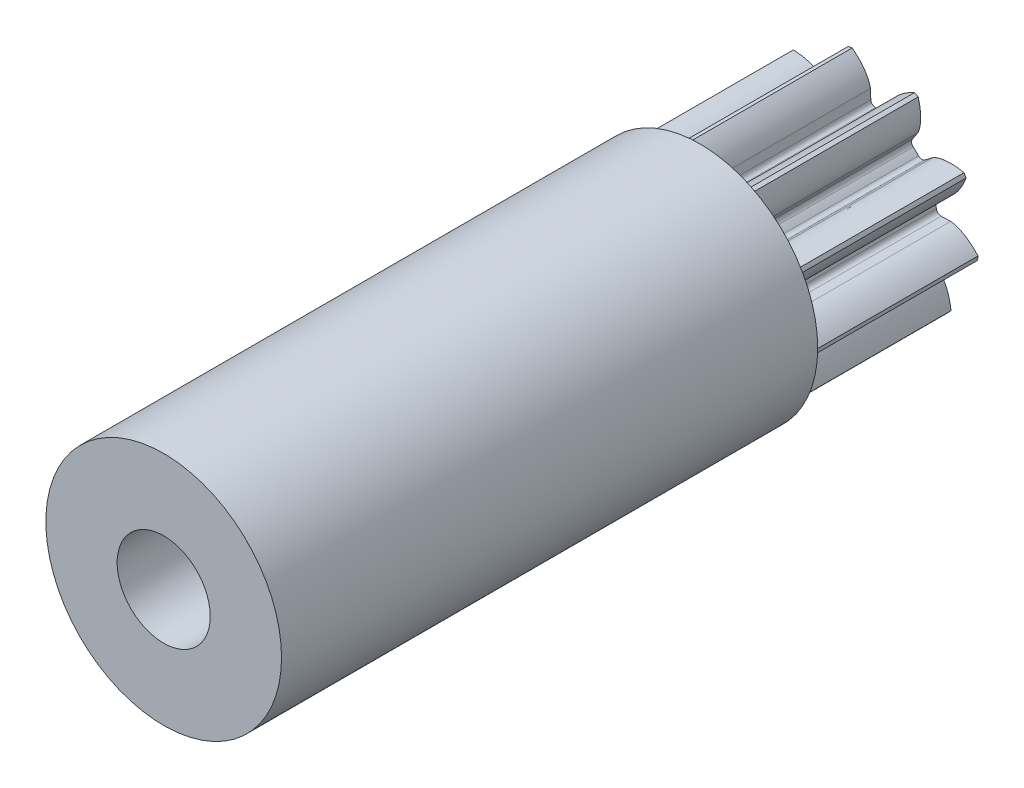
from build123d import *

# Parameters (mm, degrees)
ESQUISSE1_W        = 1
ESQUISSE1_H        = 4.55
BOSS_EXTRU_1_DEPTH = 1.45
PER_AGE1_D         = 0.79
PER_AGE1_DEPTH     = 4.2
CONG_1_R           = 0.04
CONG_2_R           = 0.2


with BuildPart() as part:
    # Esquisse1 → R_volution1 (revolve)
    with BuildSketch(Plane(origin=(0, 0, 0), x_dir=(1, 0, 0), z_dir=(0, 1, 0))):
        with Locations((0.5, -8.625)):
            Rectangle(ESQUISSE1_W, ESQUISSE1_H)
    revolve(axis=Axis((0, 0, 6.35), (0, 0, 1)))

    # Esquisse2 → Boss.-Extru.1 (add)
    with BuildSketch(Plane(origin=(0, 0, 6.35), x_dir=(-1, 0, 0), z_dir=(0, 0, -1))):
        with BuildLine():
            Line((0.002392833, -0.562494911), (-0.003155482, -0.679723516))
            add(Edge.make_bspline(
                [(-0.003155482, -0.679723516), (-0.003805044, -0.693447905), (-0.008104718, -0.706890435), (-0.012835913, -0.719789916), (-0.0255126, -0.754352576), (-0.045809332, -0.786237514), (-0.068738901, -0.815038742), (-0.094375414, -0.84724009), (-0.124574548, -0.876031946), (-0.156958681, -0.90143717)],
                knots=[0, 0, 0, 0, 4.1219e-05, 4.1219e-05, 4.1219e-05, 0.000152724, 0.000152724, 0.000152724, 0.000277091, 0.000277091, 0.000277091, 0.000277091], degree=3))
            ThreePointArc((-0.156958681, -0.90143717), (-0.174339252, -0.898237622), (-0.191654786, -0.894702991))
            add(Edge.make_bspline(
                [(-0.191654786, -0.894702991), (-0.204416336, -0.872526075), (-0.215896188, -0.849528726), (-0.225560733, -0.825837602), (-0.235219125, -0.802161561), (-0.243088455, -0.777646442), (-0.248696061, -0.752698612), (-0.254160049, -0.728389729), (-0.257630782, -0.703384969), (-0.257477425, -0.678470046), (-0.257380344, -0.662697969), (-0.256552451, -0.646441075), (-0.251350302, -0.631551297)],
                knots=[0, 0, 0, 0, 7.676e-05, 7.676e-05, 7.676e-05, 0.000153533, 0.000153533, 0.000153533, 0.000228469, 0.000228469, 0.000228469, 0.000275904, 0.000275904, 0.000275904, 0.000275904], degree=3))
            Line((-0.251350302, -0.631551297), (-0.212641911, -0.520758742))
            ThreePointArc((-0.212641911, -0.520758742), (-0.272567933, -0.492049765), (-0.32869037, -0.456474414))
            Line((-0.32869037, -0.456474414), (-0.402084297, -0.54805313))
            add(Edge.make_bspline(
                [(-0.402084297, -0.54805313), (-0.410676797, -0.558774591), (-0.422056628, -0.567122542), (-0.433466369, -0.574777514), (-0.464037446, -0.595288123), (-0.499199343, -0.609153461), (-0.534678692, -0.618976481), (-0.574346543, -0.629959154), (-0.615701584, -0.63550165), (-0.656833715, -0.637019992)],
                knots=[0, 0, 0, 0, 4.1219e-05, 4.1219e-05, 4.1219e-05, 0.000152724, 0.000152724, 0.000152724, 0.000277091, 0.000277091, 0.000277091, 0.000277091], degree=3))
            ThreePointArc((-0.656833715, -0.637019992), (-0.669014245, -0.62421546), (-0.680945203, -0.611178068))
            add(Edge.make_bspline(
                [(-0.680945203, -0.611178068), (-0.678234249, -0.585735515), (-0.674004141, -0.560382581), (-0.66789763, -0.535535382), (-0.661795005, -0.510704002), (-0.653751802, -0.486245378), (-0.643624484, -0.462766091), (-0.63375654, -0.439888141), (-0.621866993, -0.417618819), (-0.607098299, -0.397552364), (-0.597749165, -0.384849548), (-0.587523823, -0.372184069), (-0.574563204, -0.363195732)],
                knots=[0, 0, 0, 0, 7.676e-05, 7.676e-05, 7.676e-05, 0.000153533, 0.000153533, 0.000153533, 0.000228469, 0.000228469, 0.000228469, 0.000275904, 0.000275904, 0.000275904, 0.000275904], degree=3))
            Line((-0.574563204, -0.363195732), (-0.478125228, -0.296314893))
            ThreePointArc((-0.478125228, -0.296314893), (-0.509731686, -0.237865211), (-0.534225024, -0.176096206))
            Line((-0.534225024, -0.176096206), (-0.647430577, -0.207045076))
            add(Edge.make_bspline(
                [(-0.647430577, -0.207045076), (-0.660683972, -0.210668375), (-0.674797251, -0.210733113), (-0.688527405, -0.210219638), (-0.72531576, -0.208843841), (-0.761912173, -0.19939349), (-0.796389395, -0.186486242), (-0.834936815, -0.172055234), (-0.871651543, -0.152231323), (-0.905820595, -0.129282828)],
                knots=[0, 0, 0, 0, 4.1219e-05, 4.1219e-05, 4.1219e-05, 0.000152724, 0.000152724, 0.000152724, 0.000277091, 0.000277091, 0.000277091, 0.000277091], degree=3))
            ThreePointArc((-0.905820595, -0.129282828), (-0.908148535, -0.111764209), (-0.910137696, -0.094203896))
            add(Edge.make_bspline(
                [(-0.910137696, -0.094203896), (-0.892989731, -0.075213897), (-0.874665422, -0.057189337), (-0.855120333, -0.040676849), (-0.835587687, -0.024174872), (-0.81470418, -0.009115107), (-0.792710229, 0.003927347), (-0.771279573, 0.016635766), (-0.748571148, 0.027663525), (-0.724828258, 0.035216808), (-0.709798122, 0.039998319), (-0.694081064, 0.044234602), (-0.678312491, 0.043888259)],
                knots=[0, 0, 0, 0, 7.676e-05, 7.676e-05, 7.676e-05, 0.000153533, 0.000153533, 0.000153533, 0.000228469, 0.000228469, 0.000228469, 0.000275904, 0.000275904, 0.000275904, 0.000275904], degree=3))
            Line((-0.678312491, 0.043888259), (-0.56098096, 0.041311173))
            ThreePointArc((-0.56098096, 0.041311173), (-0.552195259, 0.10717577), (-0.535703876, 0.171544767))
            Line((-0.535703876, 0.171544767), (-0.645480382, 0.21304716))
            add(Edge.make_bspline(
                [(-0.645480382, 0.21304716), (-0.658332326, 0.217905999), (-0.669788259, 0.226149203), (-0.680594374, 0.234634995), (-0.709548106, 0.25737169), (-0.733600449, 0.286528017), (-0.753906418, 0.317235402), (-0.776609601, 0.351567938), (-0.794660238, 0.389186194), (-0.808814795, 0.427835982)],
                knots=[0, 0, 0, 0, 4.1219e-05, 4.1219e-05, 4.1219e-05, 0.000152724, 0.000152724, 0.000152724, 0.000277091, 0.000277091, 0.000277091, 0.000277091], degree=3))
            ThreePointArc((-0.808814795, 0.427835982), (-0.800400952, 0.443377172), (-0.791688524, 0.458752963))
            add(Edge.make_bspline(
                [(-0.791688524, 0.458752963), (-0.766653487, 0.464036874), (-0.74123424, 0.46784829), (-0.715716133, 0.469718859), (-0.690214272, 0.471588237), (-0.664467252, 0.471496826), (-0.63900761, 0.469120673), (-0.614200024, 0.466805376), (-0.589346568, 0.462379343), (-0.565698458, 0.454534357), (-0.550728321, 0.449568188), (-0.53552293, 0.443757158), (-0.522969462, 0.434208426)],
                knots=[0, 0, 0, 0, 7.676e-05, 7.676e-05, 7.676e-05, 0.000153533, 0.000153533, 0.000153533, 0.000228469, 0.000228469, 0.000228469, 0.000275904, 0.000275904, 0.000275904, 0.000275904], degree=3))
            Line((-0.522969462, 0.434208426), (-0.429561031, 0.363157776))
            ThreePointArc((-0.429561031, 0.363157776), (-0.383739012, 0.411279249), (-0.332562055, 0.45366147))
            Line((-0.332562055, 0.45366147), (-0.39697862, 0.551762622))
            add(Edge.make_bspline(
                [(-0.39697862, 0.551762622), (-0.404520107, 0.563247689), (-0.408942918, 0.576650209), (-0.412697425, 0.589867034), (-0.422757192, 0.625279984), (-0.425078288, 0.66300556), (-0.423456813, 0.699783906), (-0.421643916, 0.740904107), (-0.414135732, 0.781947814), (-0.402869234, 0.821535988)],
                knots=[0, 0, 0, 0, 4.1219e-05, 4.1219e-05, 4.1219e-05, 0.000152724, 0.000152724, 0.000152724, 0.000277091, 0.000277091, 0.000277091, 0.000277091], degree=3))
            ThreePointArc((-0.402869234, 0.821535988), (-0.38692741, 0.829163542), (-0.370841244, 0.836481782))
            add(Edge.make_bspline(
                [(-0.370841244, 0.836481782), (-0.347481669, 0.82604133), (-0.324676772, 0.814183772), (-0.302932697, 0.800697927), (-0.281202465, 0.787220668), (-0.260426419, 0.772012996), (-0.241225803, 0.755125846), (-0.222516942, 0.738671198), (-0.205011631, 0.720481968), (-0.190491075, 0.70023523), (-0.18129902, 0.687418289), (-0.172413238, 0.673779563), (-0.167869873, 0.658675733)],
                knots=[0, 0, 0, 0, 7.676e-05, 7.676e-05, 7.676e-05, 0.000153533, 0.000153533, 0.000153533, 0.000228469, 0.000228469, 0.000228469, 0.000275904, 0.000275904, 0.000275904, 0.000275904], degree=3))
            Line((-0.167869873, 0.658675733), (-0.134063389, 0.546290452))
            ThreePointArc((-0.134063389, 0.546290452), (-0.068707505, 0.558288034), (-0.002392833, 0.562494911))
            Line((-0.002392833, 0.562494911), (0.003155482, 0.679723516))
            add(Edge.make_bspline(
                [(0.003155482, 0.679723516), (0.003805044, 0.693447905), (0.008104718, 0.706890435), (0.012835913, 0.719789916), (0.0255126, 0.754352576), (0.045809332, 0.786237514), (0.068738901, 0.815038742), (0.094375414, 0.84724009), (0.124574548, 0.876031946), (0.156958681, 0.90143717)],
                knots=[0, 0, 0, 0, 4.1219e-05, 4.1219e-05, 4.1219e-05, 0.000152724, 0.000152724, 0.000152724, 0.000277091, 0.000277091, 0.000277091, 0.000277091], degree=3))
            ThreePointArc((0.156958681, 0.90143717), (0.174339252, 0.898237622), (0.191654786, 0.894702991))
            add(Edge.make_bspline(
                [(0.191654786, 0.894702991), (0.204416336, 0.872526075), (0.215896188, 0.849528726), (0.225560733, 0.825837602), (0.235219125, 0.802161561), (0.243088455, 0.777646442), (0.248696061, 0.752698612), (0.254160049, 0.728389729), (0.257630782, 0.703384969), (0.257477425, 0.678470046), (0.257380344, 0.662697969), (0.256552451, 0.646441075), (0.251350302, 0.631551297)],
                knots=[0, 0, 0, 0, 7.676e-05, 7.676e-05, 7.676e-05, 0.000153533, 0.000153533, 0.000153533, 0.000228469, 0.000228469, 0.000228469, 0.000275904, 0.000275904, 0.000275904, 0.000275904], degree=3))
            Line((0.251350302, 0.631551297), (0.212641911, 0.520758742))
            ThreePointArc((0.212641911, 0.520758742), (0.272567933, 0.492049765), (0.32869037, 0.456474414))
            Line((0.32869037, 0.456474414), (0.402084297, 0.54805313))
            add(Edge.make_bspline(
                [(0.402084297, 0.54805313), (0.410676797, 0.558774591), (0.422056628, 0.567122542), (0.433466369, 0.574777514), (0.464037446, 0.595288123), (0.499199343, 0.609153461), (0.534678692, 0.618976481), (0.574346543, 0.629959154), (0.615701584, 0.63550165), (0.656833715, 0.637019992)],
                knots=[0, 0, 0, 0, 4.1219e-05, 4.1219e-05, 4.1219e-05, 0.000152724, 0.000152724, 0.000152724, 0.000277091, 0.000277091, 0.000277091, 0.000277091], degree=3))
            ThreePointArc((0.656833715, 0.637019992), (0.669014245, 0.62421546), (0.680945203, 0.611178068))
            add(Edge.make_bspline(
                [(0.680945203, 0.611178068), (0.678234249, 0.585735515), (0.674004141, 0.560382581), (0.66789763, 0.535535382), (0.661795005, 0.510704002), (0.653751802, 0.486245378), (0.643624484, 0.462766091), (0.63375654, 0.439888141), (0.621866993, 0.417618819), (0.607098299, 0.397552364), (0.597749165, 0.384849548), (0.587523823, 0.372184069), (0.574563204, 0.363195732)],
                knots=[0, 0, 0, 0, 7.676e-05, 7.676e-05, 7.676e-05, 0.000153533, 0.000153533, 0.000153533, 0.000228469, 0.000228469, 0.000228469, 0.000275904, 0.000275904, 0.000275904, 0.000275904], degree=3))
            Line((0.574563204, 0.363195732), (0.478125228, 0.296314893))
            ThreePointArc((0.478125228, 0.296314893), (0.509731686, 0.237865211), (0.534225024, 0.176096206))
            Line((0.534225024, 0.176096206), (0.647430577, 0.207045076))
            add(Edge.make_bspline(
                [(0.647430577, 0.207045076), (0.660683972, 0.210668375), (0.674797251, 0.210733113), (0.688527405, 0.210219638), (0.72531576, 0.208843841), (0.761912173, 0.19939349), (0.796389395, 0.186486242), (0.834936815, 0.172055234), (0.871651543, 0.152231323), (0.905820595, 0.129282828)],
                knots=[0, 0, 0, 0, 4.1219e-05, 4.1219e-05, 4.1219e-05, 0.000152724, 0.000152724, 0.000152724, 0.000277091, 0.000277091, 0.000277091, 0.000277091], degree=3))
            ThreePointArc((0.905820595, 0.129282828), (0.908148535, 0.111764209), (0.910137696, 0.094203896))
            add(Edge.make_bspline(
                [(0.910137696, 0.094203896), (0.892989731, 0.075213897), (0.874665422, 0.057189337), (0.855120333, 0.040676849), (0.835587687, 0.024174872), (0.81470418, 0.009115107), (0.792710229, -0.003927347), (0.771279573, -0.016635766), (0.748571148, -0.027663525), (0.724828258, -0.035216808), (0.709798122, -0.039998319), (0.694081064, -0.044234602), (0.678312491, -0.043888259)],
                knots=[0, 0, 0, 0, 7.676e-05, 7.676e-05, 7.676e-05, 0.000153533, 0.000153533, 0.000153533, 0.000228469, 0.000228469, 0.000228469, 0.000275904, 0.000275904, 0.000275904, 0.000275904], degree=3))
            Line((0.678312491, -0.043888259), (0.56098096, -0.041311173))
            ThreePointArc((0.56098096, -0.041311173), (0.552195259, -0.10717577), (0.535703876, -0.171544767))
            Line((0.535703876, -0.171544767), (0.645480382, -0.21304716))
            add(Edge.make_bspline(
                [(0.645480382, -0.21304716), (0.658332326, -0.217905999), (0.669788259, -0.226149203), (0.680594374, -0.234634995), (0.709548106, -0.25737169), (0.733600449, -0.286528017), (0.753906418, -0.317235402), (0.776609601, -0.351567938), (0.794660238, -0.389186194), (0.808814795, -0.427835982)],
                knots=[0, 0, 0, 0, 4.1219e-05, 4.1219e-05, 4.1219e-05, 0.000152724, 0.000152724, 0.000152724, 0.000277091, 0.000277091, 0.000277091, 0.000277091], degree=3))
            ThreePointArc((0.808814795, -0.427835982), (0.800400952, -0.443377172), (0.791688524, -0.458752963))
            add(Edge.make_bspline(
                [(0.791688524, -0.458752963), (0.766653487, -0.464036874), (0.74123424, -0.46784829), (0.715716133, -0.469718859), (0.690214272, -0.471588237), (0.664467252, -0.471496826), (0.63900761, -0.469120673), (0.614200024, -0.466805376), (0.589346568, -0.462379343), (0.565698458, -0.454534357), (0.550728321, -0.449568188), (0.53552293, -0.443757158), (0.522969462, -0.434208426)],
                knots=[0, 0, 0, 0, 7.676e-05, 7.676e-05, 7.676e-05, 0.000153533, 0.000153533, 0.000153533, 0.000228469, 0.000228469, 0.000228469, 0.000275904, 0.000275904, 0.000275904, 0.000275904], degree=3))
            Line((0.522969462, -0.434208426), (0.429561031, -0.363157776))
            ThreePointArc((0.429561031, -0.363157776), (0.383739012, -0.411279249), (0.332562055, -0.45366147))
            Line((0.332562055, -0.45366147), (0.39697862, -0.551762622))
            add(Edge.make_bspline(
                [(0.39697862, -0.551762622), (0.404520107, -0.563247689), (0.408942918, -0.576650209), (0.412697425, -0.589867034), (0.422757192, -0.625279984), (0.425078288, -0.66300556), (0.423456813, -0.699783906), (0.421643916, -0.740904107), (0.414135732, -0.781947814), (0.402869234, -0.821535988)],
                knots=[0, 0, 0, 0, 4.1219e-05, 4.1219e-05, 4.1219e-05, 0.000152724, 0.000152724, 0.000152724, 0.000277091, 0.000277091, 0.000277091, 0.000277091], degree=3))
            ThreePointArc((0.402869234, -0.821535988), (0.38692741, -0.829163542), (0.370841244, -0.836481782))
            add(Edge.make_bspline(
                [(0.370841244, -0.836481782), (0.347481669, -0.82604133), (0.324676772, -0.814183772), (0.302932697, -0.800697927), (0.281202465, -0.787220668), (0.260426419, -0.772012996), (0.241225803, -0.755125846), (0.222516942, -0.738671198), (0.205011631, -0.720481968), (0.190491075, -0.70023523), (0.18129902, -0.687418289), (0.172413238, -0.673779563), (0.167869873, -0.658675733)],
                knots=[0, 0, 0, 0, 7.676e-05, 7.676e-05, 7.676e-05, 0.000153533, 0.000153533, 0.000153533, 0.000228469, 0.000228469, 0.000228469, 0.000275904, 0.000275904, 0.000275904, 0.000275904], degree=3))
            Line((0.167869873, -0.658675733), (0.134063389, -0.546290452))
            ThreePointArc((0.134063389, -0.546290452), (0.068707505, -0.558288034), (0.002392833, -0.562494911))
        make_face()
    extrude(amount=BOSS_EXTRU_1_DEPTH)

    # Per_age1
    with Locations(Plane.XY.offset(10.9)):
        with Locations((0, 0)):
            Hole(PER_AGE1_D / 2, depth=PER_AGE1_DEPTH)

    # Cong_1
    cong_1_edges = [part.edges().sort_by_distance(p)[0] for p in [
        (-0.002392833, -0.562494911, 5.625),
        (-0.134063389, -0.546290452, 5.625),
        (-0.332562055, -0.45366147, 5.625),
        (-0.429561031, -0.363157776, 5.625),
        (-0.535703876, -0.171544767, 5.625),
        (-0.478125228, 0.296314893, 5.625),
        (-0.32869037, 0.456474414, 5.625),
        (-0.212641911, 0.520758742, 5.625),
        (0.002392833, 0.562494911, 5.625),
        (0.134063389, 0.546290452, 5.625),
        (0.332562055, 0.45366147, 5.625),
        (0.429561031, 0.363157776, 5.625),
        (0.535703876, 0.171544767, 5.625),
        (0.56098096, 0.041311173, 5.625),
        (0.534225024, -0.176096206, 5.625),
        (0.478125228, -0.296314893, 5.625),
        (0.32869037, -0.456474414, 5.625),
        (0.212641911, -0.520758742, 5.625),
    ]]
    fillet(cong_1_edges, radius=CONG_1_R)

    # Cong_2
    cong_2_edges = [part.edges().sort_by_distance(p)[0] for p in [
        (0.395, 0, 6.7),
    ]]
    fillet(cong_2_edges, radius=CONG_2_R)


solid = part.part
